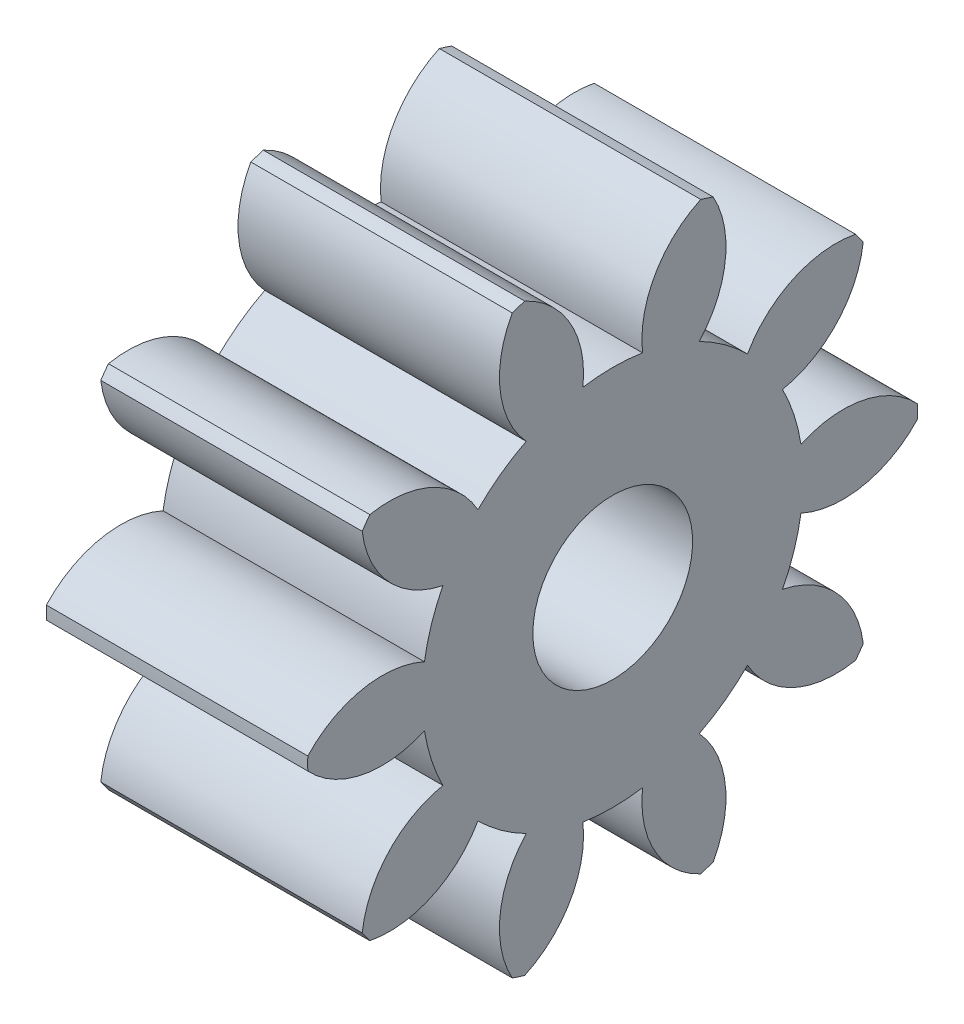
ISO-10303-21;
HEADER;
FILE_DESCRIPTION(('STEP AP214'),'2;1');
FILE_NAME('part.step','',(''),(''),'','','');
FILE_SCHEMA(('AUTOMOTIVE_DESIGN { 1 0 10303 214 1 1 1 1 }'));
ENDSEC;
DATA;
#1=APPLICATION_CONTEXT('core data for automotive mechanical design processes');
#2=APPLICATION_PROTOCOL_DEFINITION('international standard','automotive_design',2000,#1);
#3=PRODUCT_CONTEXT('',#1,'mechanical');
#4=PRODUCT('Part','Part','',(#3));
#5=PRODUCT_RELATED_PRODUCT_CATEGORY('part','',(#4));
#6=PRODUCT_DEFINITION_FORMATION('','',#4);
#7=PRODUCT_DEFINITION_CONTEXT('part definition',#1,'design');
#8=PRODUCT_DEFINITION('design','',#6,#7);
#9=PRODUCT_DEFINITION_SHAPE('','',#8);
#10=(LENGTH_UNIT() NAMED_UNIT(*) SI_UNIT(.MILLI.,.METRE.));
#11=(NAMED_UNIT(*) PLANE_ANGLE_UNIT() SI_UNIT($,.RADIAN.));
#12=(NAMED_UNIT(*) SI_UNIT($,.STERADIAN.) SOLID_ANGLE_UNIT());
#13=UNCERTAINTY_MEASURE_WITH_UNIT(LENGTH_MEASURE(1.E-05),#10,'distance_accuracy_value','');
#14=(GEOMETRIC_REPRESENTATION_CONTEXT(3) GLOBAL_UNCERTAINTY_ASSIGNED_CONTEXT((#13)) GLOBAL_UNIT_ASSIGNED_CONTEXT((#10,
#11,#12)) REPRESENTATION_CONTEXT('',''));
#15=CARTESIAN_POINT('',(0.,0.,0.));
#16=DIRECTION('',(0.,0.,1.));
#17=DIRECTION('',(1.,0.,0.));
#18=AXIS2_PLACEMENT_3D('',#15,#16,#17);
#19=CARTESIAN_POINT('',(18.,0.,0.));
#20=DIRECTION('',(-1.,0.,0.));
#21=DIRECTION('',(0.,0.,1.));
#22=AXIS2_PLACEMENT_3D('',#19,#20,#21);
#23=PLANE('',#22);
#24=CARTESIAN_POINT('',(18.,0.,0.));
#25=DIRECTION('',(-1.,0.,0.));
#26=DIRECTION('',(0.,0.,1.));
#27=AXIS2_PLACEMENT_3D('',#24,#25,#26);
#28=CIRCLE('',#27,5.5);
#29=CARTESIAN_POINT('',(18.,0.,5.5));
#30=VERTEX_POINT('',#29);
#31=EDGE_CURVE('E358',#30,#30,#28,.F.);
#32=ORIENTED_EDGE('',*,*,#31,.F.);
#33=EDGE_LOOP('',(#32));
#34=FACE_BOUND('',#33,.T.);
#35=CARTESIAN_POINT('',(18.,-4.31583887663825,-15.8681785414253));
#36=DIRECTION('',(-1.,0.,0.));
#37=DIRECTION('',(0.,-0.95105651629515,-0.309016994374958));
#38=AXIS2_PLACEMENT_3D('',#35,#36,#37);
#39=CIRCLE('',#38,7.000000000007);
#40=CARTESIAN_POINT('',(18.,2.05259812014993,-12.9624926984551));
#41=VERTEX_POINT('',#40);
#42=CARTESIAN_POINT('',(18.,0.450070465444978,-20.9951765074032));
#43=VERTEX_POINT('',#42);
#44=EDGE_CURVE('E364',#41,#43,#39,.T.);
#45=ORIENTED_EDGE('',*,*,#44,.F.);
#46=CARTESIAN_POINT('',(18.,0.,0.));
#47=DIRECTION('',(-1.,0.,0.));
#48=DIRECTION('',(0.,-0.95105651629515,-0.309016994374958));
#49=AXIS2_PLACEMENT_3D('',#46,#47,#48);
#50=CIRCLE('',#49,13.1240000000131);
#51=CARTESIAN_POINT('',(18.,5.95857527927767,-11.6933637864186));
#52=VERTEX_POINT('',#51);
#53=EDGE_CURVE('E369',#52,#41,#50,.T.);
#54=ORIENTED_EDGE('',*,*,#53,.F.);
#55=CARTESIAN_POINT('',(18.,12.8186683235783,-10.3008396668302));
#56=DIRECTION('',(-1.,0.,0.));
#57=DIRECTION('',(0.,-0.95105651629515,-0.309016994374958));
#58=AXIS2_PLACEMENT_3D('',#55,#56,#57);
#59=CIRCLE('',#58,7.000000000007);
#60=CARTESIAN_POINT('',(18.,11.9765404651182,-17.2499993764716));
#61=VERTEX_POINT('',#60);
#62=EDGE_CURVE('E366',#61,#52,#59,.T.);
#63=ORIENTED_EDGE('',*,*,#62,.F.);
#64=CARTESIAN_POINT('',(18.,0.,0.));
#65=DIRECTION('',(-1.,0.,0.));
#66=DIRECTION('',(0.,0.,1.));
#67=AXIS2_PLACEMENT_3D('',#64,#65,#66);
#68=CIRCLE('',#67,21.000000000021);
#69=CARTESIAN_POINT('',(18.,12.7047697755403,-16.7209098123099));
#70=VERTEX_POINT('',#69);
#71=EDGE_CURVE('E530',#70,#61,#68,.T.);
#72=ORIENTED_EDGE('',*,*,#71,.F.);
#73=CARTESIAN_POINT('',(18.,5.83549433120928,-15.3744125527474));
#74=DIRECTION('',(-1.,0.,0.));
#75=DIRECTION('',(0.,-0.587785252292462,-0.809016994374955));
#76=AXIS2_PLACEMENT_3D('',#73,#74,#75);
#77=CIRCLE('',#76,7.000000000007);
#78=CARTESIAN_POINT('',(18.,9.27974880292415,-9.28038997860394));
#79=VERTEX_POINT('',#78);
#80=EDGE_CURVE('E349',#79,#70,#77,.T.);
#81=ORIENTED_EDGE('',*,*,#80,.F.);
#82=CARTESIAN_POINT('',(18.,0.,0.));
#83=DIRECTION('',(-1.,0.,0.));
#84=DIRECTION('',(0.,-0.587785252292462,-0.809016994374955));
#85=AXIS2_PLACEMENT_3D('',#82,#83,#84);
#86=CIRCLE('',#85,13.1240000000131);
#87=CARTESIAN_POINT('',(18.,11.6937754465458,-5.95776735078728));
#88=VERTEX_POINT('',#87);
#89=EDGE_CURVE('E354',#88,#79,#86,.T.);
#90=ORIENTED_EDGE('',*,*,#89,.F.);
#91=CARTESIAN_POINT('',(18.,16.4252021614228,-0.798930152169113));
#92=DIRECTION('',(-1.,0.,0.));
#93=DIRECTION('',(0.,-0.587785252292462,-0.809016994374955));
#94=AXIS2_PLACEMENT_3D('',#91,#92,#93);
#95=CIRCLE('',#94,7.000000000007);
#96=CARTESIAN_POINT('',(18.,19.8285200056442,-6.91590878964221));
#97=VERTEX_POINT('',#96);
#98=EDGE_CURVE('E351',#97,#88,#95,.T.);
#99=ORIENTED_EDGE('',*,*,#98,.F.);
#100=CARTESIAN_POINT('',(18.,20.1066788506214,-6.05982389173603));
#101=VERTEX_POINT('',#100);
#102=EDGE_CURVE('E526',#101,#97,#68,.T.);
#103=ORIENTED_EDGE('',*,*,#102,.F.);
#104=CARTESIAN_POINT('',(18.,13.7578670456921,-9.00814352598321));
#105=DIRECTION('',(-1.,0.,0.));
#106=DIRECTION('',(0.,0.,-1.));
#107=AXIS2_PLACEMENT_3D('',#104,#105,#106);
#108=CIRCLE('',#107,7.000000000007);
#109=CARTESIAN_POINT('',(18.,12.9623508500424,-2.05349371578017));
#110=VERTEX_POINT('',#109);
#111=EDGE_CURVE('E498',#110,#101,#108,.T.);
#112=ORIENTED_EDGE('',*,*,#111,.F.);
#113=CARTESIAN_POINT('',(18.,0.,0.));
#114=DIRECTION('',(-1.,0.,0.));
#115=DIRECTION('',(0.,0.,-1.));
#116=AXIS2_PLACEMENT_3D('',#113,#114,#115);
#117=CIRCLE('',#116,13.1240000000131);
#118=CARTESIAN_POINT('',(18.,12.9623508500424,2.05349371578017));
#119=VERTEX_POINT('',#118);
#120=EDGE_CURVE('E503',#119,#110,#117,.T.);
#121=ORIENTED_EDGE('',*,*,#120,.F.);
#122=CARTESIAN_POINT('',(18.,13.7578670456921,9.00814352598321));
#123=DIRECTION('',(-1.,0.,0.));
#124=DIRECTION('',(0.,0.,-1.));
#125=AXIS2_PLACEMENT_3D('',#122,#123,#124);
#126=CIRCLE('',#125,7.000000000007);
#127=CARTESIAN_POINT('',(18.,20.1066788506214,6.05982389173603));
#128=VERTEX_POINT('',#127);
#129=EDGE_CURVE('E500',#128,#119,#126,.T.);
#130=ORIENTED_EDGE('',*,*,#129,.F.);
#131=CARTESIAN_POINT('',(18.,19.8285200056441,6.9159087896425));
#132=VERTEX_POINT('',#131);
#133=EDGE_CURVE('E523',#132,#128,#68,.T.);
#134=ORIENTED_EDGE('',*,*,#133,.F.);
#135=CARTESIAN_POINT('',(18.,16.4252021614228,0.798930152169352));
#136=DIRECTION('',(-1.,0.,0.));
#137=DIRECTION('',(0.,0.587785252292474,-0.809016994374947));
#138=AXIS2_PLACEMENT_3D('',#135,#136,#137);
#139=CIRCLE('',#138,7.000000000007);
#140=CARTESIAN_POINT('',(18.,11.6937754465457,5.95776735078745));
#141=VERTEX_POINT('',#140);
#142=EDGE_CURVE('E476',#141,#132,#139,.T.);
#143=ORIENTED_EDGE('',*,*,#142,.F.);
#144=CARTESIAN_POINT('',(18.,0.,0.));
#145=DIRECTION('',(-1.,0.,0.));
#146=DIRECTION('',(0.,0.587785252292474,-0.809016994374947));
#147=AXIS2_PLACEMENT_3D('',#144,#145,#146);
#148=CIRCLE('',#147,13.1240000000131);
#149=CARTESIAN_POINT('',(18.,9.27974880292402,9.28038997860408));
#150=VERTEX_POINT('',#149);
#151=EDGE_CURVE('E481',#150,#141,#148,.T.);
#152=ORIENTED_EDGE('',*,*,#151,.F.);
#153=CARTESIAN_POINT('',(18.,5.83549433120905,15.3744125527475));
#154=DIRECTION('',(-1.,0.,0.));
#155=DIRECTION('',(0.,0.587785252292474,-0.809016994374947));
#156=AXIS2_PLACEMENT_3D('',#153,#154,#155);
#157=CIRCLE('',#156,7.000000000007);
#158=CARTESIAN_POINT('',(18.,12.70476977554,16.72090981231));
#159=VERTEX_POINT('',#158);
#160=EDGE_CURVE('E478',#159,#150,#157,.T.);
#161=ORIENTED_EDGE('',*,*,#160,.F.);
#162=CARTESIAN_POINT('',(18.,11.9765404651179,17.2499993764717));
#163=VERTEX_POINT('',#162);
#164=EDGE_CURVE('E531',#163,#159,#68,.T.);
#165=ORIENTED_EDGE('',*,*,#164,.F.);
#166=CARTESIAN_POINT('',(18.,12.8186683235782,10.3008396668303));
#167=DIRECTION('',(-1.,0.,0.));
#168=DIRECTION('',(0.,0.951056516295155,-0.309016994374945));
#169=AXIS2_PLACEMENT_3D('',#166,#167,#168);
#170=CIRCLE('',#169,7.000000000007);
#171=CARTESIAN_POINT('',(18.,5.95857527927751,11.6933637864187));
#172=VERTEX_POINT('',#171);
#173=EDGE_CURVE('E411',#172,#163,#170,.T.);
#174=ORIENTED_EDGE('',*,*,#173,.F.);
#175=CARTESIAN_POINT('',(18.,0.,0.));
#176=DIRECTION('',(-1.,0.,0.));
#177=DIRECTION('',(0.,0.951056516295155,-0.309016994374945));
#178=AXIS2_PLACEMENT_3D('',#175,#176,#177);
#179=CIRCLE('',#178,13.1240000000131);
#180=CARTESIAN_POINT('',(18.,2.05259812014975,12.9624926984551));
#181=VERTEX_POINT('',#180);
#182=EDGE_CURVE('E416',#181,#172,#179,.T.);
#183=ORIENTED_EDGE('',*,*,#182,.F.);
#184=CARTESIAN_POINT('',(18.,-4.31583887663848,15.8681785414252));
#185=DIRECTION('',(-1.,0.,0.));
#186=DIRECTION('',(0.,0.951056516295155,-0.309016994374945));
#187=AXIS2_PLACEMENT_3D('',#184,#185,#186);
#188=CIRCLE('',#187,7.000000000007);
#189=CARTESIAN_POINT('',(18.,0.45007046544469,20.9951765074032));
#190=VERTEX_POINT('',#189);
#191=EDGE_CURVE('E413',#190,#181,#188,.T.);
#192=ORIENTED_EDGE('',*,*,#191,.F.);
#193=CARTESIAN_POINT('',(18.,-0.450070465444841,20.9951765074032));
#194=VERTEX_POINT('',#193);
#195=EDGE_CURVE('E694',#194,#190,#68,.T.);
#196=ORIENTED_EDGE('',*,*,#195,.F.);
#197=CARTESIAN_POINT('',(18.,4.31583887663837,15.8681785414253));
#198=DIRECTION('',(-1.,0.,0.));
#199=DIRECTION('',(0.,0.951056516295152,0.309016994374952));
#200=AXIS2_PLACEMENT_3D('',#197,#198,#199);
#201=CIRCLE('',#200,7.000000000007);
#202=CARTESIAN_POINT('',(18.,-2.05259812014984,12.9624926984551));
#203=VERTEX_POINT('',#202);
#204=EDGE_CURVE('E430',#203,#194,#201,.T.);
#205=ORIENTED_EDGE('',*,*,#204,.F.);
#206=CARTESIAN_POINT('',(18.,0.,0.));
#207=DIRECTION('',(-1.,0.,0.));
#208=DIRECTION('',(0.,0.951056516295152,0.309016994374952));
#209=AXIS2_PLACEMENT_3D('',#206,#207,#208);
#210=CIRCLE('',#209,13.1240000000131);
#211=CARTESIAN_POINT('',(18.,-5.95857527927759,11.6933637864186));
#212=VERTEX_POINT('',#211);
#213=EDGE_CURVE('E435',#212,#203,#210,.T.);
#214=ORIENTED_EDGE('',*,*,#213,.F.);
#215=CARTESIAN_POINT('',(18.,-12.8186683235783,10.3008396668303));
#216=DIRECTION('',(-1.,0.,0.));
#217=DIRECTION('',(0.,0.951056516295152,0.309016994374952));
#218=AXIS2_PLACEMENT_3D('',#215,#216,#217);
#219=CIRCLE('',#218,7.000000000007);
#220=CARTESIAN_POINT('',(18.,-11.976540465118,17.2499993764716));
#221=VERTEX_POINT('',#220);
#222=EDGE_CURVE('E432',#221,#212,#219,.T.);
#223=ORIENTED_EDGE('',*,*,#222,.F.);
#224=CARTESIAN_POINT('',(18.,-12.7047697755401,16.72090981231));
#225=VERTEX_POINT('',#224);
#226=EDGE_CURVE('E675',#225,#221,#68,.T.);
#227=ORIENTED_EDGE('',*,*,#226,.F.);
#228=CARTESIAN_POINT('',(18.,-5.83549433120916,15.3744125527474));
#229=DIRECTION('',(-1.,0.,0.));
#230=DIRECTION('',(0.,0.587785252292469,0.809016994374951));
#231=AXIS2_PLACEMENT_3D('',#228,#229,#230);
#232=CIRCLE('',#231,7.000000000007);
#233=CARTESIAN_POINT('',(18.,-9.27974880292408,9.28038997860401));
#234=VERTEX_POINT('',#233);
#235=EDGE_CURVE('E394',#234,#225,#232,.T.);
#236=ORIENTED_EDGE('',*,*,#235,.F.);
#237=CARTESIAN_POINT('',(18.,0.,0.));
#238=DIRECTION('',(-1.,0.,0.));
#239=DIRECTION('',(0.,0.587785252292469,0.809016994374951));
#240=AXIS2_PLACEMENT_3D('',#237,#238,#239);
#241=CIRCLE('',#240,13.1240000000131);
#242=CARTESIAN_POINT('',(18.,-11.6937754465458,5.95776735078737));
#243=VERTEX_POINT('',#242);
#244=EDGE_CURVE('E399',#243,#234,#241,.T.);
#245=ORIENTED_EDGE('',*,*,#244,.F.);
#246=CARTESIAN_POINT('',(18.,-16.4252021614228,0.798930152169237));
#247=DIRECTION('',(-1.,0.,0.));
#248=DIRECTION('',(0.,0.587785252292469,0.809016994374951));
#249=AXIS2_PLACEMENT_3D('',#246,#247,#248);
#250=CIRCLE('',#249,7.000000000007);
#251=CARTESIAN_POINT('',(18.,-19.8285200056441,6.91590878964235));
#252=VERTEX_POINT('',#251);
#253=EDGE_CURVE('E396',#252,#243,#250,.T.);
#254=ORIENTED_EDGE('',*,*,#253,.F.);
#255=CARTESIAN_POINT('',(18.,-20.1066788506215,6.05982389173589));
#256=VERTEX_POINT('',#255);
#257=EDGE_CURVE('E656',#256,#252,#68,.T.);
#258=ORIENTED_EDGE('',*,*,#257,.F.);
#259=CARTESIAN_POINT('',(18.,-13.7578670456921,9.00814352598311));
#260=DIRECTION('',(-1.,0.,0.));
#261=DIRECTION('',(0.,0.,1.));
#262=AXIS2_PLACEMENT_3D('',#259,#260,#261);
#263=CIRCLE('',#262,7.000000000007);
#264=CARTESIAN_POINT('',(18.,-12.9623508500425,2.05349371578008));
#265=VERTEX_POINT('',#264);
#266=EDGE_CURVE('E377',#265,#256,#263,.T.);
#267=ORIENTED_EDGE('',*,*,#266,.F.);
#268=CARTESIAN_POINT('',(18.,0.,0.));
#269=DIRECTION('',(-1.,0.,0.));
#270=DIRECTION('',(0.,0.,1.));
#271=AXIS2_PLACEMENT_3D('',#268,#269,#270);
#272=CIRCLE('',#271,13.1240000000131);
#273=CARTESIAN_POINT('',(18.,-12.9623508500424,-2.05349371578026));
#274=VERTEX_POINT('',#273);
#275=EDGE_CURVE('E382',#274,#265,#272,.T.);
#276=ORIENTED_EDGE('',*,*,#275,.F.);
#277=CARTESIAN_POINT('',(18.,-13.757867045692,-9.0081435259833));
#278=DIRECTION('',(-1.,0.,0.));
#279=DIRECTION('',(0.,0.,1.));
#280=AXIS2_PLACEMENT_3D('',#277,#278,#279);
#281=CIRCLE('',#280,7.000000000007);
#282=CARTESIAN_POINT('',(18.,-20.1066788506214,-6.05982389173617));
#283=VERTEX_POINT('',#282);
#284=EDGE_CURVE('E379',#283,#274,#281,.T.);
#285=ORIENTED_EDGE('',*,*,#284,.F.);
#286=CARTESIAN_POINT('',(18.,-19.828520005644,-6.91590878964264));
#287=VERTEX_POINT('',#286);
#288=EDGE_CURVE('E637',#287,#283,#68,.T.);
#289=ORIENTED_EDGE('',*,*,#288,.F.);
#290=CARTESIAN_POINT('',(18.,-16.4252021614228,-0.798930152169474));
#291=DIRECTION('',(-1.,0.,0.));
#292=DIRECTION('',(0.,-0.58778525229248,0.809016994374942));
#293=AXIS2_PLACEMENT_3D('',#290,#291,#292);
#294=CIRCLE('',#293,7.000000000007);
#295=CARTESIAN_POINT('',(18.,-11.6937754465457,-5.95776735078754));
#296=VERTEX_POINT('',#295);
#297=EDGE_CURVE('E332',#296,#287,#294,.T.);
#298=ORIENTED_EDGE('',*,*,#297,.F.);
#299=CARTESIAN_POINT('',(18.,0.,0.));
#300=DIRECTION('',(-1.,0.,0.));
#301=DIRECTION('',(0.,-0.58778525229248,0.809016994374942));
#302=AXIS2_PLACEMENT_3D('',#299,#300,#301);
#303=CIRCLE('',#302,13.1240000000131);
#304=CARTESIAN_POINT('',(18.,-9.27974880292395,-9.28038997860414));
#305=VERTEX_POINT('',#304);
#306=EDGE_CURVE('E337',#305,#296,#303,.T.);
#307=ORIENTED_EDGE('',*,*,#306,.F.);
#308=CARTESIAN_POINT('',(18.,-5.83549433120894,-15.3744125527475));
#309=DIRECTION('',(-1.,0.,0.));
#310=DIRECTION('',(0.,-0.58778525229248,0.809016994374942));
#311=AXIS2_PLACEMENT_3D('',#308,#309,#310);
#312=CIRCLE('',#311,7.000000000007);
#313=CARTESIAN_POINT('',(18.,-12.7047697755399,-16.7209098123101));
#314=VERTEX_POINT('',#313);
#315=EDGE_CURVE('E334',#314,#305,#312,.T.);
#316=ORIENTED_EDGE('',*,*,#315,.F.);
#317=CARTESIAN_POINT('',(18.,-11.9765404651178,-17.2499993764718));
#318=VERTEX_POINT('',#317);
#319=EDGE_CURVE('E618',#318,#314,#68,.T.);
#320=ORIENTED_EDGE('',*,*,#319,.F.);
#321=CARTESIAN_POINT('',(18.,-12.8186683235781,-10.3008396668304));
#322=DIRECTION('',(-1.,0.,0.));
#323=DIRECTION('',(0.,-0.951056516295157,0.309016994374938));
#324=AXIS2_PLACEMENT_3D('',#321,#322,#323);
#325=CIRCLE('',#324,7.000000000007);
#326=CARTESIAN_POINT('',(18.,-5.95857527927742,-11.6933637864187));
#327=VERTEX_POINT('',#326);
#328=EDGE_CURVE('E308',#327,#318,#325,.T.);
#329=ORIENTED_EDGE('',*,*,#328,.F.);
#330=CARTESIAN_POINT('',(18.,0.,0.));
#331=DIRECTION('',(-1.,0.,0.));
#332=DIRECTION('',(0.,-0.951056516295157,0.309016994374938));
#333=AXIS2_PLACEMENT_3D('',#330,#331,#332);
#334=CIRCLE('',#333,13.1240000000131);
#335=CARTESIAN_POINT('',(18.,-2.05259812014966,-12.9624926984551));
#336=VERTEX_POINT('',#335);
#337=EDGE_CURVE('E307',#336,#327,#334,.T.);
#338=ORIENTED_EDGE('',*,*,#337,.F.);
#339=CARTESIAN_POINT('',(18.,4.31583887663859,-15.8681785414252));
#340=DIRECTION('',(-1.,0.,0.));
#341=DIRECTION('',(0.,-0.951056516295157,0.309016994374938));
#342=AXIS2_PLACEMENT_3D('',#339,#340,#341);
#343=CIRCLE('',#342,7.000000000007);
#344=CARTESIAN_POINT('',(18.,-0.450070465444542,-20.9951765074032));
#345=VERTEX_POINT('',#344);
#346=EDGE_CURVE('E296',#345,#336,#343,.T.);
#347=ORIENTED_EDGE('',*,*,#346,.F.);
#348=EDGE_CURVE('E756',#43,#345,#68,.T.);
#349=ORIENTED_EDGE('',*,*,#348,.F.);
#350=EDGE_LOOP('',(#45,#54,#63,#72,#81,#90,#99,#103,#112,#121,#130,#134,#143,#152,#161,#165,
#174,#183,#192,#196,#205,#214,#223,#227,#236,#245,#254,#258,#267,#276,#285,#289,#298,#307,#316,
#320,#329,#338,#347,#349));
#351=FACE_BOUND('',#350,.T.);
#352=ADVANCED_FACE('F39',(#34,#351),#23,.F.);
#353=CARTESIAN_POINT('',(-10.,0.,0.));
#354=DIRECTION('',(-1.,0.,0.));
#355=DIRECTION('',(0.,0.,1.));
#356=AXIS2_PLACEMENT_3D('',#353,#354,#355);
#357=CYLINDRICAL_SURFACE('',#356,21.000000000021);
#358=DIRECTION('',(-1.,0.,0.));
#359=VECTOR('',#358,1.);
#360=CARTESIAN_POINT('',(9.,0.450070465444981,-20.9951765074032));
#361=LINE('',#360,#359);
#362=CARTESIAN_POINT('',(0.,0.450070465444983,-20.9951765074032));
#363=VERTEX_POINT('',#362);
#364=EDGE_CURVE('E473',#43,#363,#361,.T.);
#365=ORIENTED_EDGE('',*,*,#364,.F.);
#366=ORIENTED_EDGE('',*,*,#348,.T.);
#367=DIRECTION('',(-1.,0.,0.));
#368=VECTOR('',#367,1.);
#369=CARTESIAN_POINT('',(9.,-0.450070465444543,-20.9951765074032));
#370=LINE('',#369,#368);
#371=CARTESIAN_POINT('',(0.,-0.450070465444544,-20.9951765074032));
#372=VERTEX_POINT('',#371);
#373=EDGE_CURVE('E302',#372,#345,#370,.F.);
#374=ORIENTED_EDGE('',*,*,#373,.F.);
#375=CARTESIAN_POINT('',(0.,0.,0.));
#376=DIRECTION('',(-1.,0.,0.));
#377=DIRECTION('',(0.,0.,1.));
#378=AXIS2_PLACEMENT_3D('',#375,#376,#377);
#379=CIRCLE('',#378,21.000000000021);
#380=EDGE_CURVE('E588',#363,#372,#379,.T.);
#381=ORIENTED_EDGE('',*,*,#380,.F.);
#382=EDGE_LOOP('',(#365,#366,#374,#381));
#383=FACE_BOUND('',#382,.T.);
#384=ADVANCED_FACE('F739',(#383),#357,.T.);
#385=DIRECTION('',(-1.,0.,0.));
#386=VECTOR('',#385,1.);
#387=CARTESIAN_POINT('',(9.,11.9765404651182,-17.2499993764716));
#388=LINE('',#387,#386);
#389=CARTESIAN_POINT('',(0.,11.9765404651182,-17.2499993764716));
#390=VERTEX_POINT('',#389);
#391=EDGE_CURVE('E471',#390,#61,#388,.F.);
#392=ORIENTED_EDGE('',*,*,#391,.F.);
#393=CARTESIAN_POINT('',(0.,12.7047697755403,-16.7209098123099));
#394=VERTEX_POINT('',#393);
#395=EDGE_CURVE('E524',#394,#390,#379,.T.);
#396=ORIENTED_EDGE('',*,*,#395,.F.);
#397=DIRECTION('',(-1.,0.,0.));
#398=VECTOR('',#397,1.);
#399=CARTESIAN_POINT('',(9.,12.7047697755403,-16.7209098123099));
#400=LINE('',#399,#398);
#401=EDGE_CURVE('E469',#70,#394,#400,.T.);
#402=ORIENTED_EDGE('',*,*,#401,.F.);
#403=ORIENTED_EDGE('',*,*,#71,.T.);
#404=EDGE_LOOP('',(#392,#396,#402,#403));
#405=FACE_BOUND('',#404,.T.);
#406=ADVANCED_FACE('F585',(#405),#357,.T.);
#407=DIRECTION('',(-1.,0.,0.));
#408=VECTOR('',#407,1.);
#409=CARTESIAN_POINT('',(9.,19.8285200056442,-6.9159087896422));
#410=LINE('',#409,#408);
#411=CARTESIAN_POINT('',(0.,19.8285200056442,-6.91590878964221));
#412=VERTEX_POINT('',#411);
#413=EDGE_CURVE('E467',#412,#97,#410,.F.);
#414=ORIENTED_EDGE('',*,*,#413,.F.);
#415=CARTESIAN_POINT('',(0.,20.1066788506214,-6.05982389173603));
#416=VERTEX_POINT('',#415);
#417=EDGE_CURVE('E520',#416,#412,#379,.T.);
#418=ORIENTED_EDGE('',*,*,#417,.F.);
#419=DIRECTION('',(-1.,0.,0.));
#420=VECTOR('',#419,1.);
#421=CARTESIAN_POINT('',(9.,20.1066788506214,-6.05982389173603));
#422=LINE('',#421,#420);
#423=EDGE_CURVE('E517',#101,#416,#422,.T.);
#424=ORIENTED_EDGE('',*,*,#423,.F.);
#425=ORIENTED_EDGE('',*,*,#102,.T.);
#426=EDGE_LOOP('',(#414,#418,#424,#425));
#427=FACE_BOUND('',#426,.T.);
#428=ADVANCED_FACE('F559',(#427),#357,.T.);
#429=DIRECTION('',(-1.,0.,0.));
#430=VECTOR('',#429,1.);
#431=CARTESIAN_POINT('',(9.,-19.828520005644,-6.91590878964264));
#432=LINE('',#431,#430);
#433=CARTESIAN_POINT('',(0.,-19.828520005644,-6.91590878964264));
#434=VERTEX_POINT('',#433);
#435=EDGE_CURVE('E465',#287,#434,#432,.T.);
#436=ORIENTED_EDGE('',*,*,#435,.F.);
#437=ORIENTED_EDGE('',*,*,#288,.T.);
#438=DIRECTION('',(-1.,0.,0.));
#439=VECTOR('',#438,1.);
#440=CARTESIAN_POINT('',(9.,-20.1066788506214,-6.05982389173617));
#441=LINE('',#440,#439);
#442=CARTESIAN_POINT('',(0.,-20.1066788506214,-6.05982389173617));
#443=VERTEX_POINT('',#442);
#444=EDGE_CURVE('E448',#443,#283,#441,.F.);
#445=ORIENTED_EDGE('',*,*,#444,.F.);
#446=EDGE_CURVE('E604',#434,#443,#379,.T.);
#447=ORIENTED_EDGE('',*,*,#446,.F.);
#448=EDGE_LOOP('',(#436,#437,#445,#447));
#449=FACE_BOUND('',#448,.T.);
#450=ADVANCED_FACE('F635',(#449),#357,.T.);
#451=DIRECTION('',(-1.,0.,0.));
#452=VECTOR('',#451,1.);
#453=CARTESIAN_POINT('',(9.,-12.7047697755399,-16.7209098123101));
#454=LINE('',#453,#452);
#455=CARTESIAN_POINT('',(0.,-12.7047697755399,-16.7209098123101));
#456=VERTEX_POINT('',#455);
#457=EDGE_CURVE('E463',#456,#314,#454,.F.);
#458=ORIENTED_EDGE('',*,*,#457,.F.);
#459=CARTESIAN_POINT('',(0.,-11.9765404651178,-17.2499993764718));
#460=VERTEX_POINT('',#459);
#461=EDGE_CURVE('E590',#460,#456,#379,.T.);
#462=ORIENTED_EDGE('',*,*,#461,.F.);
#463=DIRECTION('',(-1.,0.,0.));
#464=VECTOR('',#463,1.);
#465=CARTESIAN_POINT('',(9.,-11.9765404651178,-17.2499993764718));
#466=LINE('',#465,#464);
#467=EDGE_CURVE('E461',#318,#460,#466,.T.);
#468=ORIENTED_EDGE('',*,*,#467,.F.);
#469=ORIENTED_EDGE('',*,*,#319,.T.);
#470=EDGE_LOOP('',(#458,#462,#468,#469));
#471=FACE_BOUND('',#470,.T.);
#472=ADVANCED_FACE('F616',(#471),#357,.T.);
#473=DIRECTION('',(-1.,0.,0.));
#474=VECTOR('',#473,1.);
#475=CARTESIAN_POINT('',(9.,11.9765404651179,17.2499993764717));
#476=LINE('',#475,#474);
#477=CARTESIAN_POINT('',(0.,11.9765404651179,17.2499993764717));
#478=VERTEX_POINT('',#477);
#479=EDGE_CURVE('E458',#163,#478,#476,.T.);
#480=ORIENTED_EDGE('',*,*,#479,.F.);
#481=ORIENTED_EDGE('',*,*,#164,.T.);
#482=DIRECTION('',(-1.,0.,0.));
#483=VECTOR('',#482,1.);
#484=CARTESIAN_POINT('',(9.,12.70476977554,16.72090981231));
#485=LINE('',#484,#483);
#486=CARTESIAN_POINT('',(0.,12.70476977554,16.72090981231));
#487=VERTEX_POINT('',#486);
#488=EDGE_CURVE('E492',#487,#159,#485,.F.);
#489=ORIENTED_EDGE('',*,*,#488,.F.);
#490=EDGE_CURVE('E525',#478,#487,#379,.T.);
#491=ORIENTED_EDGE('',*,*,#490,.F.);
#492=EDGE_LOOP('',(#480,#481,#489,#491));
#493=FACE_BOUND('',#492,.T.);
#494=ADVANCED_FACE('F711',(#493),#357,.T.);
#495=DIRECTION('',(-1.,0.,0.));
#496=VECTOR('',#495,1.);
#497=CARTESIAN_POINT('',(9.,0.450070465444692,20.9951765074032));
#498=LINE('',#497,#496);
#499=CARTESIAN_POINT('',(0.,0.450070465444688,20.9951765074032));
#500=VERTEX_POINT('',#499);
#501=EDGE_CURVE('E456',#500,#190,#498,.F.);
#502=ORIENTED_EDGE('',*,*,#501,.F.);
#503=CARTESIAN_POINT('',(0.,-0.450070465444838,20.9951765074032));
#504=VERTEX_POINT('',#503);
#505=EDGE_CURVE('E592',#504,#500,#379,.T.);
#506=ORIENTED_EDGE('',*,*,#505,.F.);
#507=DIRECTION('',(-1.,0.,0.));
#508=VECTOR('',#507,1.);
#509=CARTESIAN_POINT('',(9.,-0.450070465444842,20.9951765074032));
#510=LINE('',#509,#508);
#511=EDGE_CURVE('E454',#194,#504,#510,.T.);
#512=ORIENTED_EDGE('',*,*,#511,.F.);
#513=ORIENTED_EDGE('',*,*,#195,.T.);
#514=EDGE_LOOP('',(#502,#506,#512,#513));
#515=FACE_BOUND('',#514,.T.);
#516=ADVANCED_FACE('F692',(#515),#357,.T.);
#517=DIRECTION('',(-1.,0.,0.));
#518=VECTOR('',#517,1.);
#519=CARTESIAN_POINT('',(9.,-11.976540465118,17.2499993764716));
#520=LINE('',#519,#518);
#521=CARTESIAN_POINT('',(0.,-11.976540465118,17.2499993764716));
#522=VERTEX_POINT('',#521);
#523=EDGE_CURVE('E452',#522,#221,#520,.F.);
#524=ORIENTED_EDGE('',*,*,#523,.F.);
#525=CARTESIAN_POINT('',(0.,-12.7047697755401,16.72090981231));
#526=VERTEX_POINT('',#525);
#527=EDGE_CURVE('E596',#526,#522,#379,.T.);
#528=ORIENTED_EDGE('',*,*,#527,.F.);
#529=DIRECTION('',(-1.,0.,0.));
#530=VECTOR('',#529,1.);
#531=CARTESIAN_POINT('',(9.,-12.7047697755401,16.72090981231));
#532=LINE('',#531,#530);
#533=EDGE_CURVE('E446',#225,#526,#532,.T.);
#534=ORIENTED_EDGE('',*,*,#533,.F.);
#535=ORIENTED_EDGE('',*,*,#226,.T.);
#536=EDGE_LOOP('',(#524,#528,#534,#535));
#537=FACE_BOUND('',#536,.T.);
#538=ADVANCED_FACE('F673',(#537),#357,.T.);
#539=DIRECTION('',(-1.,0.,0.));
#540=VECTOR('',#539,1.);
#541=CARTESIAN_POINT('',(9.,-20.1066788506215,6.0598238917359));
#542=LINE('',#541,#540);
#543=CARTESIAN_POINT('',(0.,-20.1066788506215,6.05982389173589));
#544=VERTEX_POINT('',#543);
#545=EDGE_CURVE('E450',#256,#544,#542,.T.);
#546=ORIENTED_EDGE('',*,*,#545,.F.);
#547=ORIENTED_EDGE('',*,*,#257,.T.);
#548=DIRECTION('',(-1.,0.,0.));
#549=VECTOR('',#548,1.);
#550=CARTESIAN_POINT('',(9.,-19.8285200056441,6.91590878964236));
#551=LINE('',#550,#549);
#552=CARTESIAN_POINT('',(0.,-19.8285200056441,6.91590878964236));
#553=VERTEX_POINT('',#552);
#554=EDGE_CURVE('E429',#553,#252,#551,.F.);
#555=ORIENTED_EDGE('',*,*,#554,.F.);
#556=EDGE_CURVE('E600',#544,#553,#379,.T.);
#557=ORIENTED_EDGE('',*,*,#556,.F.);
#558=EDGE_LOOP('',(#546,#547,#555,#557));
#559=FACE_BOUND('',#558,.T.);
#560=ADVANCED_FACE('F654',(#559),#357,.T.);
#561=CARTESIAN_POINT('',(0.,0.,0.));
#562=DIRECTION('',(1.,0.,0.));
#563=DIRECTION('',(0.,0.,-1.));
#564=AXIS2_PLACEMENT_3D('',#561,#562,#563);
#565=PLANE('',#564);
#566=CARTESIAN_POINT('',(0.,0.,0.));
#567=DIRECTION('',(1.,0.,0.));
#568=DIRECTION('',(0.,0.,-1.));
#569=AXIS2_PLACEMENT_3D('',#566,#567,#568);
#570=CIRCLE('',#569,5.5);
#571=CARTESIAN_POINT('',(0.,0.,-5.5));
#572=VERTEX_POINT('',#571);
#573=EDGE_CURVE('E42',#572,#572,#570,.F.);
#574=ORIENTED_EDGE('',*,*,#573,.F.);
#575=EDGE_LOOP('',(#574));
#576=FACE_BOUND('',#575,.T.);
#577=CARTESIAN_POINT('',(0.,-4.31583887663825,-15.8681785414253));
#578=DIRECTION('',(-1.,0.,0.));
#579=DIRECTION('',(0.,-0.95105651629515,-0.309016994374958));
#580=AXIS2_PLACEMENT_3D('',#577,#578,#579);
#581=CIRCLE('',#580,7.000000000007);
#582=CARTESIAN_POINT('',(0.,2.05259812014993,-12.9624926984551));
#583=VERTEX_POINT('',#582);
#584=EDGE_CURVE('E54',#583,#363,#581,.T.);
#585=ORIENTED_EDGE('',*,*,#584,.T.);
#586=ORIENTED_EDGE('',*,*,#380,.T.);
#587=CARTESIAN_POINT('',(0.,4.31583887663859,-15.8681785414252));
#588=DIRECTION('',(1.,0.,0.));
#589=DIRECTION('',(0.,0.,-1.));
#590=AXIS2_PLACEMENT_3D('',#587,#588,#589);
#591=CIRCLE('',#590,7.000000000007);
#592=CARTESIAN_POINT('',(0.,-2.05259812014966,-12.9624926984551));
#593=VERTEX_POINT('',#592);
#594=EDGE_CURVE('E545',#593,#372,#591,.T.);
#595=ORIENTED_EDGE('',*,*,#594,.F.);
#596=CARTESIAN_POINT('',(0.,0.,0.));
#597=DIRECTION('',(-1.,0.,0.));
#598=DIRECTION('',(0.,-0.951056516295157,0.309016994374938));
#599=AXIS2_PLACEMENT_3D('',#596,#597,#598);
#600=CIRCLE('',#599,13.1240000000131);
#601=CARTESIAN_POINT('',(0.,-5.95857527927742,-11.6933637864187));
#602=VERTEX_POINT('',#601);
#603=EDGE_CURVE('E315',#593,#602,#600,.T.);
#604=ORIENTED_EDGE('',*,*,#603,.T.);
#605=CARTESIAN_POINT('',(0.,-12.8186683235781,-10.3008396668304));
#606=DIRECTION('',(-1.,0.,0.));
#607=DIRECTION('',(0.,-0.951056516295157,0.309016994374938));
#608=AXIS2_PLACEMENT_3D('',#605,#606,#607);
#609=CIRCLE('',#608,7.000000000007);
#610=EDGE_CURVE('E327',#602,#460,#609,.T.);
#611=ORIENTED_EDGE('',*,*,#610,.T.);
#612=ORIENTED_EDGE('',*,*,#461,.T.);
#613=CARTESIAN_POINT('',(0.,-5.83549433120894,-15.3744125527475));
#614=DIRECTION('',(1.,0.,0.));
#615=DIRECTION('',(0.,0.,-1.));
#616=AXIS2_PLACEMENT_3D('',#613,#614,#615);
#617=CIRCLE('',#616,7.000000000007);
#618=CARTESIAN_POINT('',(0.,-9.27974880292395,-9.28038997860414));
#619=VERTEX_POINT('',#618);
#620=EDGE_CURVE('E547',#619,#456,#617,.T.);
#621=ORIENTED_EDGE('',*,*,#620,.F.);
#622=CARTESIAN_POINT('',(0.,0.,0.));
#623=DIRECTION('',(-1.,0.,0.));
#624=DIRECTION('',(0.,-0.58778525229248,0.809016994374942));
#625=AXIS2_PLACEMENT_3D('',#622,#623,#624);
#626=CIRCLE('',#625,13.1240000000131);
#627=CARTESIAN_POINT('',(0.,-11.6937754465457,-5.95776735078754));
#628=VERTEX_POINT('',#627);
#629=EDGE_CURVE('E335',#619,#628,#626,.T.);
#630=ORIENTED_EDGE('',*,*,#629,.T.);
#631=CARTESIAN_POINT('',(0.,-16.4252021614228,-0.798930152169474));
#632=DIRECTION('',(-1.,0.,0.));
#633=DIRECTION('',(0.,-0.58778525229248,0.809016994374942));
#634=AXIS2_PLACEMENT_3D('',#631,#632,#633);
#635=CIRCLE('',#634,7.000000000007);
#636=EDGE_CURVE('E317',#628,#434,#635,.T.);
#637=ORIENTED_EDGE('',*,*,#636,.T.);
#638=ORIENTED_EDGE('',*,*,#446,.T.);
#639=CARTESIAN_POINT('',(0.,-13.757867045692,-9.0081435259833));
#640=DIRECTION('',(1.,0.,0.));
#641=DIRECTION('',(0.,0.,-1.));
#642=AXIS2_PLACEMENT_3D('',#639,#640,#641);
#643=CIRCLE('',#642,7.000000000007);
#644=CARTESIAN_POINT('',(0.,-12.9623508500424,-2.05349371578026));
#645=VERTEX_POINT('',#644);
#646=EDGE_CURVE('E539',#645,#443,#643,.T.);
#647=ORIENTED_EDGE('',*,*,#646,.F.);
#648=CARTESIAN_POINT('',(0.,0.,0.));
#649=DIRECTION('',(-1.,0.,0.));
#650=DIRECTION('',(0.,0.,1.));
#651=AXIS2_PLACEMENT_3D('',#648,#649,#650);
#652=CIRCLE('',#651,13.1240000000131);
#653=CARTESIAN_POINT('',(0.,-12.9623508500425,2.05349371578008));
#654=VERTEX_POINT('',#653);
#655=EDGE_CURVE('E380',#645,#654,#652,.T.);
#656=ORIENTED_EDGE('',*,*,#655,.T.);
#657=CARTESIAN_POINT('',(0.,-13.7578670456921,9.00814352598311));
#658=DIRECTION('',(-1.,0.,0.));
#659=DIRECTION('',(0.,0.,1.));
#660=AXIS2_PLACEMENT_3D('',#657,#658,#659);
#661=CIRCLE('',#660,7.000000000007);
#662=EDGE_CURVE('E348',#654,#544,#661,.T.);
#663=ORIENTED_EDGE('',*,*,#662,.T.);
#664=ORIENTED_EDGE('',*,*,#556,.T.);
#665=CARTESIAN_POINT('',(0.,-16.4252021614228,0.798930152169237));
#666=DIRECTION('',(1.,0.,0.));
#667=DIRECTION('',(0.,0.,-1.));
#668=AXIS2_PLACEMENT_3D('',#665,#666,#667);
#669=CIRCLE('',#668,7.000000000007);
#670=CARTESIAN_POINT('',(0.,-11.6937754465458,5.95776735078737));
#671=VERTEX_POINT('',#670);
#672=EDGE_CURVE('E537',#671,#553,#669,.T.);
#673=ORIENTED_EDGE('',*,*,#672,.F.);
#674=CARTESIAN_POINT('',(0.,0.,0.));
#675=DIRECTION('',(-1.,0.,0.));
#676=DIRECTION('',(0.,0.587785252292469,0.809016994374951));
#677=AXIS2_PLACEMENT_3D('',#674,#675,#676);
#678=CIRCLE('',#677,13.1240000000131);
#679=CARTESIAN_POINT('',(0.,-9.27974880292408,9.28038997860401));
#680=VERTEX_POINT('',#679);
#681=EDGE_CURVE('E397',#671,#680,#678,.T.);
#682=ORIENTED_EDGE('',*,*,#681,.T.);
#683=CARTESIAN_POINT('',(0.,-5.83549433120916,15.3744125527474));
#684=DIRECTION('',(-1.,0.,0.));
#685=DIRECTION('',(0.,0.587785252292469,0.809016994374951));
#686=AXIS2_PLACEMENT_3D('',#683,#684,#685);
#687=CIRCLE('',#686,7.000000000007);
#688=EDGE_CURVE('E393',#680,#526,#687,.T.);
#689=ORIENTED_EDGE('',*,*,#688,.T.);
#690=ORIENTED_EDGE('',*,*,#527,.T.);
#691=CARTESIAN_POINT('',(0.,-12.8186683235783,10.3008396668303));
#692=DIRECTION('',(1.,0.,0.));
#693=DIRECTION('',(0.,0.,-1.));
#694=AXIS2_PLACEMENT_3D('',#691,#692,#693);
#695=CIRCLE('',#694,7.000000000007);
#696=CARTESIAN_POINT('',(0.,-5.95857527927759,11.6933637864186));
#697=VERTEX_POINT('',#696);
#698=EDGE_CURVE('E541',#697,#522,#695,.T.);
#699=ORIENTED_EDGE('',*,*,#698,.F.);
#700=CARTESIAN_POINT('',(0.,0.,0.));
#701=DIRECTION('',(-1.,0.,0.));
#702=DIRECTION('',(0.,0.951056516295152,0.309016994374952));
#703=AXIS2_PLACEMENT_3D('',#700,#701,#702);
#704=CIRCLE('',#703,13.1240000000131);
#705=CARTESIAN_POINT('',(0.,-2.05259812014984,12.9624926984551));
#706=VERTEX_POINT('',#705);
#707=EDGE_CURVE('E433',#697,#706,#704,.T.);
#708=ORIENTED_EDGE('',*,*,#707,.T.);
#709=CARTESIAN_POINT('',(0.,4.31583887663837,15.8681785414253));
#710=DIRECTION('',(-1.,0.,0.));
#711=DIRECTION('',(0.,0.951056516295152,0.309016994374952));
#712=AXIS2_PLACEMENT_3D('',#709,#710,#711);
#713=CIRCLE('',#712,7.000000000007);
#714=EDGE_CURVE('E410',#706,#504,#713,.T.);
#715=ORIENTED_EDGE('',*,*,#714,.T.);
#716=ORIENTED_EDGE('',*,*,#505,.T.);
#717=CARTESIAN_POINT('',(0.,-4.31583887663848,15.8681785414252));
#718=DIRECTION('',(1.,0.,0.));
#719=DIRECTION('',(0.,0.,-1.));
#720=AXIS2_PLACEMENT_3D('',#717,#718,#719);
#721=CIRCLE('',#720,7.000000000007);
#722=CARTESIAN_POINT('',(0.,2.05259812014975,12.9624926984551));
#723=VERTEX_POINT('',#722);
#724=EDGE_CURVE('E543',#723,#500,#721,.T.);
#725=ORIENTED_EDGE('',*,*,#724,.F.);
#726=CARTESIAN_POINT('',(0.,0.,0.));
#727=DIRECTION('',(-1.,0.,0.));
#728=DIRECTION('',(0.,0.951056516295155,-0.309016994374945));
#729=AXIS2_PLACEMENT_3D('',#726,#727,#728);
#730=CIRCLE('',#729,13.1240000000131);
#731=CARTESIAN_POINT('',(0.,5.9585752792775,11.6933637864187));
#732=VERTEX_POINT('',#731);
#733=EDGE_CURVE('E414',#723,#732,#730,.T.);
#734=ORIENTED_EDGE('',*,*,#733,.T.);
#735=CARTESIAN_POINT('',(0.,12.8186683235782,10.3008396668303));
#736=DIRECTION('',(-1.,0.,0.));
#737=DIRECTION('',(0.,0.951056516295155,-0.309016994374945));
#738=AXIS2_PLACEMENT_3D('',#735,#736,#737);
#739=CIRCLE('',#738,7.000000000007);
#740=EDGE_CURVE('E419',#732,#478,#739,.T.);
#741=ORIENTED_EDGE('',*,*,#740,.T.);
#742=ORIENTED_EDGE('',*,*,#490,.T.);
#743=CARTESIAN_POINT('',(0.,5.83549433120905,15.3744125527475));
#744=DIRECTION('',(1.,0.,0.));
#745=DIRECTION('',(0.,0.,-1.));
#746=AXIS2_PLACEMENT_3D('',#743,#744,#745);
#747=CIRCLE('',#746,7.000000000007);
#748=CARTESIAN_POINT('',(0.,9.27974880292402,9.28038997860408));
#749=VERTEX_POINT('',#748);
#750=EDGE_CURVE('E534',#749,#487,#747,.T.);
#751=ORIENTED_EDGE('',*,*,#750,.F.);
#752=CARTESIAN_POINT('',(0.,0.,0.));
#753=DIRECTION('',(-1.,0.,0.));
#754=DIRECTION('',(0.,0.587785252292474,-0.809016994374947));
#755=AXIS2_PLACEMENT_3D('',#752,#753,#754);
#756=CIRCLE('',#755,13.1240000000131);
#757=CARTESIAN_POINT('',(0.,11.6937754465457,5.95776735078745));
#758=VERTEX_POINT('',#757);
#759=EDGE_CURVE('E479',#749,#758,#756,.T.);
#760=ORIENTED_EDGE('',*,*,#759,.T.);
#761=CARTESIAN_POINT('',(0.,16.4252021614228,0.798930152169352));
#762=DIRECTION('',(-1.,0.,0.));
#763=DIRECTION('',(0.,0.587785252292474,-0.809016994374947));
#764=AXIS2_PLACEMENT_3D('',#761,#762,#763);
#765=CIRCLE('',#764,7.000000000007);
#766=CARTESIAN_POINT('',(0.,19.8285200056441,6.9159087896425));
#767=VERTEX_POINT('',#766);
#768=EDGE_CURVE('E475',#758,#767,#765,.T.);
#769=ORIENTED_EDGE('',*,*,#768,.T.);
#770=CARTESIAN_POINT('',(0.,20.1066788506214,6.05982389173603));
#771=VERTEX_POINT('',#770);
#772=EDGE_CURVE('E519',#767,#771,#379,.T.);
#773=ORIENTED_EDGE('',*,*,#772,.T.);
#774=CARTESIAN_POINT('',(0.,13.7578670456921,9.00814352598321));
#775=DIRECTION('',(1.,0.,0.));
#776=DIRECTION('',(0.,0.,-1.));
#777=AXIS2_PLACEMENT_3D('',#774,#775,#776);
#778=CIRCLE('',#777,7.000000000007);
#779=CARTESIAN_POINT('',(0.,12.9623508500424,2.05349371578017));
#780=VERTEX_POINT('',#779);
#781=EDGE_CURVE('E529',#780,#771,#778,.T.);
#782=ORIENTED_EDGE('',*,*,#781,.F.);
#783=CARTESIAN_POINT('',(0.,0.,0.));
#784=DIRECTION('',(-1.,0.,0.));
#785=DIRECTION('',(0.,0.,-1.));
#786=AXIS2_PLACEMENT_3D('',#783,#784,#785);
#787=CIRCLE('',#786,13.1240000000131);
#788=CARTESIAN_POINT('',(0.,12.9623508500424,-2.05349371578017));
#789=VERTEX_POINT('',#788);
#790=EDGE_CURVE('E501',#780,#789,#787,.T.);
#791=ORIENTED_EDGE('',*,*,#790,.T.);
#792=CARTESIAN_POINT('',(0.,13.7578670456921,-9.00814352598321));
#793=DIRECTION('',(-1.,0.,0.));
#794=DIRECTION('',(0.,0.,-1.));
#795=AXIS2_PLACEMENT_3D('',#792,#793,#794);
#796=CIRCLE('',#795,7.000000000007);
#797=EDGE_CURVE('E497',#789,#416,#796,.T.);
#798=ORIENTED_EDGE('',*,*,#797,.T.);
#799=ORIENTED_EDGE('',*,*,#417,.T.);
#800=CARTESIAN_POINT('',(0.,16.4252021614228,-0.798930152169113));
#801=DIRECTION('',(1.,0.,0.));
#802=DIRECTION('',(0.,0.,-1.));
#803=AXIS2_PLACEMENT_3D('',#800,#801,#802);
#804=CIRCLE('',#803,7.000000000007);
#805=CARTESIAN_POINT('',(0.,11.6937754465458,-5.95776735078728));
#806=VERTEX_POINT('',#805);
#807=EDGE_CURVE('E47',#806,#412,#804,.T.);
#808=ORIENTED_EDGE('',*,*,#807,.F.);
#809=CARTESIAN_POINT('',(0.,0.,0.));
#810=DIRECTION('',(-1.,0.,0.));
#811=DIRECTION('',(0.,-0.587785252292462,-0.809016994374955));
#812=AXIS2_PLACEMENT_3D('',#809,#810,#811);
#813=CIRCLE('',#812,13.1240000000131);
#814=CARTESIAN_POINT('',(0.,9.27974880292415,-9.28038997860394));
#815=VERTEX_POINT('',#814);
#816=EDGE_CURVE('E352',#806,#815,#813,.T.);
#817=ORIENTED_EDGE('',*,*,#816,.T.);
#818=CARTESIAN_POINT('',(0.,5.83549433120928,-15.3744125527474));
#819=DIRECTION('',(-1.,0.,0.));
#820=DIRECTION('',(0.,-0.587785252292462,-0.809016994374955));
#821=AXIS2_PLACEMENT_3D('',#818,#819,#820);
#822=CIRCLE('',#821,7.000000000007);
#823=EDGE_CURVE('E62',#815,#394,#822,.T.);
#824=ORIENTED_EDGE('',*,*,#823,.T.);
#825=ORIENTED_EDGE('',*,*,#395,.T.);
#826=CARTESIAN_POINT('',(0.,12.8186683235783,-10.3008396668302));
#827=DIRECTION('',(1.,0.,0.));
#828=DIRECTION('',(0.,0.,-1.));
#829=AXIS2_PLACEMENT_3D('',#826,#827,#828);
#830=CIRCLE('',#829,7.000000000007);
#831=CARTESIAN_POINT('',(0.,5.95857527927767,-11.6933637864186));
#832=VERTEX_POINT('',#831);
#833=EDGE_CURVE('E11',#832,#390,#830,.T.);
#834=ORIENTED_EDGE('',*,*,#833,.F.);
#835=CARTESIAN_POINT('',(0.,0.,0.));
#836=DIRECTION('',(-1.,0.,0.));
#837=DIRECTION('',(0.,-0.95105651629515,-0.309016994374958));
#838=AXIS2_PLACEMENT_3D('',#835,#836,#837);
#839=CIRCLE('',#838,13.1240000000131);
#840=EDGE_CURVE('E367',#832,#583,#839,.T.);
#841=ORIENTED_EDGE('',*,*,#840,.T.);
#842=EDGE_LOOP('',(#585,#586,#595,#604,#611,#612,#621,#630,#637,#638,#647,#656,#663,#664,#673,
#682,#689,#690,#699,#708,#715,#716,#725,#734,#741,#742,#751,#760,#769,#773,#782,#791,#798,#799,
#808,#817,#824,#825,#834,#841));
#843=FACE_BOUND('',#842,.T.);
#844=ADVANCED_FACE('F562',(#576,#843),#565,.F.);
#845=DIRECTION('',(-1.,0.,0.));
#846=VECTOR('',#845,1.);
#847=CARTESIAN_POINT('',(9.,19.8285200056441,6.9159087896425));
#848=LINE('',#847,#846);
#849=EDGE_CURVE('E495',#132,#767,#848,.T.);
#850=ORIENTED_EDGE('',*,*,#849,.F.);
#851=ORIENTED_EDGE('',*,*,#133,.T.);
#852=DIRECTION('',(-1.,0.,0.));
#853=VECTOR('',#852,1.);
#854=CARTESIAN_POINT('',(9.,20.1066788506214,6.05982389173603));
#855=LINE('',#854,#853);
#856=EDGE_CURVE('E514',#771,#128,#855,.F.);
#857=ORIENTED_EDGE('',*,*,#856,.F.);
#858=ORIENTED_EDGE('',*,*,#772,.F.);
#859=EDGE_LOOP('',(#850,#851,#857,#858));
#860=FACE_BOUND('',#859,.T.);
#861=ADVANCED_FACE('F727',(#860),#357,.T.);
#862=CARTESIAN_POINT('',(18.,13.7578670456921,-9.00814352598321));
#863=DIRECTION('',(-1.,0.,0.));
#864=DIRECTION('',(0.,0.,1.));
#865=AXIS2_PLACEMENT_3D('',#862,#863,#864);
#866=CYLINDRICAL_SURFACE('',#865,7.000000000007);
#867=ORIENTED_EDGE('',*,*,#423,.T.);
#868=ORIENTED_EDGE('',*,*,#797,.F.);
#869=DIRECTION('',(-1.,0.,0.));
#870=VECTOR('',#869,1.);
#871=CARTESIAN_POINT('',(18.,12.9623508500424,-2.05349371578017));
#872=LINE('',#871,#870);
#873=EDGE_CURVE('E505',#110,#789,#872,.T.);
#874=ORIENTED_EDGE('',*,*,#873,.F.);
#875=ORIENTED_EDGE('',*,*,#111,.T.);
#876=EDGE_LOOP('',(#867,#868,#874,#875));
#877=FACE_BOUND('',#876,.T.);
#878=ADVANCED_FACE('F567',(#877),#866,.T.);
#879=CARTESIAN_POINT('',(18.,13.7578670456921,9.00814352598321));
#880=DIRECTION('',(-1.,0.,0.));
#881=DIRECTION('',(0.,0.,1.));
#882=AXIS2_PLACEMENT_3D('',#879,#880,#881);
#883=CYLINDRICAL_SURFACE('',#882,7.000000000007);
#884=ORIENTED_EDGE('',*,*,#856,.T.);
#885=ORIENTED_EDGE('',*,*,#129,.T.);
#886=DIRECTION('',(-1.,0.,0.));
#887=VECTOR('',#886,1.);
#888=CARTESIAN_POINT('',(18.,12.9623508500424,2.05349371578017));
#889=LINE('',#888,#887);
#890=EDGE_CURVE('E512',#119,#780,#889,.T.);
#891=ORIENTED_EDGE('',*,*,#890,.T.);
#892=ORIENTED_EDGE('',*,*,#781,.T.);
#893=EDGE_LOOP('',(#884,#885,#891,#892));
#894=FACE_BOUND('',#893,.T.);
#895=ADVANCED_FACE('F729',(#894),#883,.T.);
#896=CARTESIAN_POINT('',(18.,0.,0.));
#897=DIRECTION('',(-1.,0.,0.));
#898=DIRECTION('',(0.,0.,1.));
#899=AXIS2_PLACEMENT_3D('',#896,#897,#898);
#900=CYLINDRICAL_SURFACE('',#899,13.1240000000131);
#901=ORIENTED_EDGE('',*,*,#790,.F.);
#902=ORIENTED_EDGE('',*,*,#890,.F.);
#903=ORIENTED_EDGE('',*,*,#120,.T.);
#904=ORIENTED_EDGE('',*,*,#873,.T.);
#905=EDGE_LOOP('',(#901,#902,#903,#904));
#906=FACE_BOUND('',#905,.T.);
#907=ADVANCED_FACE('F570',(#906),#900,.T.);
#908=CARTESIAN_POINT('',(18.,16.4252021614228,0.798930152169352));
#909=DIRECTION('',(-1.,0.,0.));
#910=DIRECTION('',(0.,0.,1.));
#911=AXIS2_PLACEMENT_3D('',#908,#909,#910);
#912=CYLINDRICAL_SURFACE('',#911,7.000000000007);
#913=ORIENTED_EDGE('',*,*,#849,.T.);
#914=ORIENTED_EDGE('',*,*,#768,.F.);
#915=DIRECTION('',(-1.,0.,0.));
#916=VECTOR('',#915,1.);
#917=CARTESIAN_POINT('',(18.,11.6937754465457,5.95776735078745));
#918=LINE('',#917,#916);
#919=EDGE_CURVE('E483',#141,#758,#918,.T.);
#920=ORIENTED_EDGE('',*,*,#919,.F.);
#921=ORIENTED_EDGE('',*,*,#142,.T.);
#922=EDGE_LOOP('',(#913,#914,#920,#921));
#923=FACE_BOUND('',#922,.T.);
#924=ADVANCED_FACE('F723',(#923),#912,.T.);
#925=CARTESIAN_POINT('',(18.,5.83549433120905,15.3744125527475));
#926=DIRECTION('',(-1.,0.,0.));
#927=DIRECTION('',(0.,0.,1.));
#928=AXIS2_PLACEMENT_3D('',#925,#926,#927);
#929=CYLINDRICAL_SURFACE('',#928,7.000000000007);
#930=ORIENTED_EDGE('',*,*,#488,.T.);
#931=ORIENTED_EDGE('',*,*,#160,.T.);
#932=DIRECTION('',(-1.,0.,0.));
#933=VECTOR('',#932,1.);
#934=CARTESIAN_POINT('',(18.,9.27974880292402,9.28038997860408));
#935=LINE('',#934,#933);
#936=EDGE_CURVE('E490',#150,#749,#935,.T.);
#937=ORIENTED_EDGE('',*,*,#936,.T.);
#938=ORIENTED_EDGE('',*,*,#750,.T.);
#939=EDGE_LOOP('',(#930,#931,#937,#938));
#940=FACE_BOUND('',#939,.T.);
#941=ADVANCED_FACE('F714',(#940),#929,.T.);
#942=CARTESIAN_POINT('',(18.,0.,0.));
#943=DIRECTION('',(-1.,0.,0.));
#944=DIRECTION('',(0.,0.,1.));
#945=AXIS2_PLACEMENT_3D('',#942,#943,#944);
#946=CYLINDRICAL_SURFACE('',#945,13.1240000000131);
#947=ORIENTED_EDGE('',*,*,#759,.F.);
#948=ORIENTED_EDGE('',*,*,#936,.F.);
#949=ORIENTED_EDGE('',*,*,#151,.T.);
#950=ORIENTED_EDGE('',*,*,#919,.T.);
#951=EDGE_LOOP('',(#947,#948,#949,#950));
#952=FACE_BOUND('',#951,.T.);
#953=ADVANCED_FACE('F721',(#952),#946,.T.);
#954=CARTESIAN_POINT('',(18.,-5.83549433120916,15.3744125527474));
#955=DIRECTION('',(-1.,0.,0.));
#956=DIRECTION('',(0.,0.,1.));
#957=AXIS2_PLACEMENT_3D('',#954,#955,#956);
#958=CYLINDRICAL_SURFACE('',#957,7.000000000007);
#959=ORIENTED_EDGE('',*,*,#533,.T.);
#960=ORIENTED_EDGE('',*,*,#688,.F.);
#961=DIRECTION('',(-1.,0.,0.));
#962=VECTOR('',#961,1.);
#963=CARTESIAN_POINT('',(18.,-9.27974880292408,9.28038997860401));
#964=LINE('',#963,#962);
#965=EDGE_CURVE('E401',#234,#680,#964,.T.);
#966=ORIENTED_EDGE('',*,*,#965,.F.);
#967=ORIENTED_EDGE('',*,*,#235,.T.);
#968=EDGE_LOOP('',(#959,#960,#966,#967));
#969=FACE_BOUND('',#968,.T.);
#970=ADVANCED_FACE('F669',(#969),#958,.T.);
#971=CARTESIAN_POINT('',(18.,-16.4252021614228,0.798930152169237));
#972=DIRECTION('',(-1.,0.,0.));
#973=DIRECTION('',(0.,0.,1.));
#974=AXIS2_PLACEMENT_3D('',#971,#972,#973);
#975=CYLINDRICAL_SURFACE('',#974,7.000000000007);
#976=ORIENTED_EDGE('',*,*,#554,.T.);
#977=ORIENTED_EDGE('',*,*,#253,.T.);
#978=DIRECTION('',(-1.,0.,0.));
#979=VECTOR('',#978,1.);
#980=CARTESIAN_POINT('',(18.,-11.6937754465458,5.95776735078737));
#981=LINE('',#980,#979);
#982=EDGE_CURVE('E408',#243,#671,#981,.T.);
#983=ORIENTED_EDGE('',*,*,#982,.T.);
#984=ORIENTED_EDGE('',*,*,#672,.T.);
#985=EDGE_LOOP('',(#976,#977,#983,#984));
#986=FACE_BOUND('',#985,.T.);
#987=ADVANCED_FACE('F659',(#986),#975,.T.);
#988=CARTESIAN_POINT('',(18.,0.,0.));
#989=DIRECTION('',(-1.,0.,0.));
#990=DIRECTION('',(0.,0.,1.));
#991=AXIS2_PLACEMENT_3D('',#988,#989,#990);
#992=CYLINDRICAL_SURFACE('',#991,13.1240000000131);
#993=ORIENTED_EDGE('',*,*,#681,.F.);
#994=ORIENTED_EDGE('',*,*,#982,.F.);
#995=ORIENTED_EDGE('',*,*,#244,.T.);
#996=ORIENTED_EDGE('',*,*,#965,.T.);
#997=EDGE_LOOP('',(#993,#994,#995,#996));
#998=FACE_BOUND('',#997,.T.);
#999=ADVANCED_FACE('F667',(#998),#992,.T.);
#1000=CARTESIAN_POINT('',(18.,-13.7578670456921,9.00814352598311));
#1001=DIRECTION('',(-1.,0.,0.));
#1002=DIRECTION('',(0.,0.,1.));
#1003=AXIS2_PLACEMENT_3D('',#1000,#1001,#1002);
#1004=CYLINDRICAL_SURFACE('',#1003,7.000000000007);
#1005=ORIENTED_EDGE('',*,*,#545,.T.);
#1006=ORIENTED_EDGE('',*,*,#662,.F.);
#1007=DIRECTION('',(-1.,0.,0.));
#1008=VECTOR('',#1007,1.);
#1009=CARTESIAN_POINT('',(18.,-12.9623508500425,2.05349371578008));
#1010=LINE('',#1009,#1008);
#1011=EDGE_CURVE('E384',#265,#654,#1010,.T.);
#1012=ORIENTED_EDGE('',*,*,#1011,.F.);
#1013=ORIENTED_EDGE('',*,*,#266,.T.);
#1014=EDGE_LOOP('',(#1005,#1006,#1012,#1013));
#1015=FACE_BOUND('',#1014,.T.);
#1016=ADVANCED_FACE('F650',(#1015),#1004,.T.);
#1017=CARTESIAN_POINT('',(18.,-13.757867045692,-9.0081435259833));
#1018=DIRECTION('',(-1.,0.,0.));
#1019=DIRECTION('',(0.,0.,1.));
#1020=AXIS2_PLACEMENT_3D('',#1017,#1018,#1019);
#1021=CYLINDRICAL_SURFACE('',#1020,7.000000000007);
#1022=ORIENTED_EDGE('',*,*,#444,.T.);
#1023=ORIENTED_EDGE('',*,*,#284,.T.);
#1024=DIRECTION('',(-1.,0.,0.));
#1025=VECTOR('',#1024,1.);
#1026=CARTESIAN_POINT('',(18.,-12.9623508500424,-2.05349371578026));
#1027=LINE('',#1026,#1025);
#1028=EDGE_CURVE('E391',#274,#645,#1027,.T.);
#1029=ORIENTED_EDGE('',*,*,#1028,.T.);
#1030=ORIENTED_EDGE('',*,*,#646,.T.);
#1031=EDGE_LOOP('',(#1022,#1023,#1029,#1030));
#1032=FACE_BOUND('',#1031,.T.);
#1033=ADVANCED_FACE('F640',(#1032),#1021,.T.);
#1034=CARTESIAN_POINT('',(18.,0.,0.));
#1035=DIRECTION('',(-1.,0.,0.));
#1036=DIRECTION('',(0.,0.,1.));
#1037=AXIS2_PLACEMENT_3D('',#1034,#1035,#1036);
#1038=CYLINDRICAL_SURFACE('',#1037,13.1240000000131);
#1039=ORIENTED_EDGE('',*,*,#655,.F.);
#1040=ORIENTED_EDGE('',*,*,#1028,.F.);
#1041=ORIENTED_EDGE('',*,*,#275,.T.);
#1042=ORIENTED_EDGE('',*,*,#1011,.T.);
#1043=EDGE_LOOP('',(#1039,#1040,#1041,#1042));
#1044=FACE_BOUND('',#1043,.T.);
#1045=ADVANCED_FACE('F648',(#1044),#1038,.T.);
#1046=CARTESIAN_POINT('',(18.,4.31583887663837,15.8681785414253));
#1047=DIRECTION('',(-1.,0.,0.));
#1048=DIRECTION('',(0.,0.,1.));
#1049=AXIS2_PLACEMENT_3D('',#1046,#1047,#1048);
#1050=CYLINDRICAL_SURFACE('',#1049,7.000000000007);
#1051=ORIENTED_EDGE('',*,*,#511,.T.);
#1052=ORIENTED_EDGE('',*,*,#714,.F.);
#1053=DIRECTION('',(-1.,0.,0.));
#1054=VECTOR('',#1053,1.);
#1055=CARTESIAN_POINT('',(18.,-2.05259812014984,12.9624926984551));
#1056=LINE('',#1055,#1054);
#1057=EDGE_CURVE('E437',#203,#706,#1056,.T.);
#1058=ORIENTED_EDGE('',*,*,#1057,.F.);
#1059=ORIENTED_EDGE('',*,*,#204,.T.);
#1060=EDGE_LOOP('',(#1051,#1052,#1058,#1059));
#1061=FACE_BOUND('',#1060,.T.);
#1062=ADVANCED_FACE('F688',(#1061),#1050,.T.);
#1063=CARTESIAN_POINT('',(18.,-12.8186683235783,10.3008396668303));
#1064=DIRECTION('',(-1.,0.,0.));
#1065=DIRECTION('',(0.,0.,1.));
#1066=AXIS2_PLACEMENT_3D('',#1063,#1064,#1065);
#1067=CYLINDRICAL_SURFACE('',#1066,7.000000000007);
#1068=ORIENTED_EDGE('',*,*,#523,.T.);
#1069=ORIENTED_EDGE('',*,*,#222,.T.);
#1070=DIRECTION('',(-1.,0.,0.));
#1071=VECTOR('',#1070,1.);
#1072=CARTESIAN_POINT('',(18.,-5.95857527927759,11.6933637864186));
#1073=LINE('',#1072,#1071);
#1074=EDGE_CURVE('E422',#212,#697,#1073,.T.);
#1075=ORIENTED_EDGE('',*,*,#1074,.T.);
#1076=ORIENTED_EDGE('',*,*,#698,.T.);
#1077=EDGE_LOOP('',(#1068,#1069,#1075,#1076));
#1078=FACE_BOUND('',#1077,.T.);
#1079=ADVANCED_FACE('F678',(#1078),#1067,.T.);
#1080=CARTESIAN_POINT('',(18.,0.,0.));
#1081=DIRECTION('',(-1.,0.,0.));
#1082=DIRECTION('',(0.,0.,1.));
#1083=AXIS2_PLACEMENT_3D('',#1080,#1081,#1082);
#1084=CYLINDRICAL_SURFACE('',#1083,13.1240000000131);
#1085=ORIENTED_EDGE('',*,*,#707,.F.);
#1086=ORIENTED_EDGE('',*,*,#1074,.F.);
#1087=ORIENTED_EDGE('',*,*,#213,.T.);
#1088=ORIENTED_EDGE('',*,*,#1057,.T.);
#1089=EDGE_LOOP('',(#1085,#1086,#1087,#1088));
#1090=FACE_BOUND('',#1089,.T.);
#1091=ADVANCED_FACE('F686',(#1090),#1084,.T.);
#1092=CARTESIAN_POINT('',(18.,12.8186683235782,10.3008396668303));
#1093=DIRECTION('',(-1.,0.,0.));
#1094=DIRECTION('',(0.,0.,1.));
#1095=AXIS2_PLACEMENT_3D('',#1092,#1093,#1094);
#1096=CYLINDRICAL_SURFACE('',#1095,7.000000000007);
#1097=ORIENTED_EDGE('',*,*,#479,.T.);
#1098=ORIENTED_EDGE('',*,*,#740,.F.);
#1099=DIRECTION('',(-1.,0.,0.));
#1100=VECTOR('',#1099,1.);
#1101=CARTESIAN_POINT('',(18.,5.95857527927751,11.6933637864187));
#1102=LINE('',#1101,#1100);
#1103=EDGE_CURVE('E418',#172,#732,#1102,.T.);
#1104=ORIENTED_EDGE('',*,*,#1103,.F.);
#1105=ORIENTED_EDGE('',*,*,#173,.T.);
#1106=EDGE_LOOP('',(#1097,#1098,#1104,#1105));
#1107=FACE_BOUND('',#1106,.T.);
#1108=ADVANCED_FACE('F707',(#1107),#1096,.T.);
#1109=CARTESIAN_POINT('',(18.,-4.31583887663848,15.8681785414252));
#1110=DIRECTION('',(-1.,0.,0.));
#1111=DIRECTION('',(0.,0.,1.));
#1112=AXIS2_PLACEMENT_3D('',#1109,#1110,#1111);
#1113=CYLINDRICAL_SURFACE('',#1112,7.000000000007);
#1114=ORIENTED_EDGE('',*,*,#501,.T.);
#1115=ORIENTED_EDGE('',*,*,#191,.T.);
#1116=DIRECTION('',(-1.,0.,0.));
#1117=VECTOR('',#1116,1.);
#1118=CARTESIAN_POINT('',(18.,2.05259812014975,12.9624926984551));
#1119=LINE('',#1118,#1117);
#1120=EDGE_CURVE('E427',#181,#723,#1119,.T.);
#1121=ORIENTED_EDGE('',*,*,#1120,.T.);
#1122=ORIENTED_EDGE('',*,*,#724,.T.);
#1123=EDGE_LOOP('',(#1114,#1115,#1121,#1122));
#1124=FACE_BOUND('',#1123,.T.);
#1125=ADVANCED_FACE('F697',(#1124),#1113,.T.);
#1126=CARTESIAN_POINT('',(18.,0.,0.));
#1127=DIRECTION('',(-1.,0.,0.));
#1128=DIRECTION('',(0.,0.,1.));
#1129=AXIS2_PLACEMENT_3D('',#1126,#1127,#1128);
#1130=CYLINDRICAL_SURFACE('',#1129,13.1240000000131);
#1131=ORIENTED_EDGE('',*,*,#733,.F.);
#1132=ORIENTED_EDGE('',*,*,#1120,.F.);
#1133=ORIENTED_EDGE('',*,*,#182,.T.);
#1134=ORIENTED_EDGE('',*,*,#1103,.T.);
#1135=EDGE_LOOP('',(#1131,#1132,#1133,#1134));
#1136=FACE_BOUND('',#1135,.T.);
#1137=ADVANCED_FACE('F705',(#1136),#1130,.T.);
#1138=CARTESIAN_POINT('',(18.,-12.8186683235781,-10.3008396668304));
#1139=DIRECTION('',(-1.,0.,0.));
#1140=DIRECTION('',(0.,0.,1.));
#1141=AXIS2_PLACEMENT_3D('',#1138,#1139,#1140);
#1142=CYLINDRICAL_SURFACE('',#1141,7.000000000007);
#1143=ORIENTED_EDGE('',*,*,#467,.T.);
#1144=ORIENTED_EDGE('',*,*,#610,.F.);
#1145=DIRECTION('',(-1.,0.,0.));
#1146=VECTOR('',#1145,1.);
#1147=CARTESIAN_POINT('',(18.,-5.95857527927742,-11.6933637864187));
#1148=LINE('',#1147,#1146);
#1149=EDGE_CURVE('E318',#327,#602,#1148,.T.);
#1150=ORIENTED_EDGE('',*,*,#1149,.F.);
#1151=ORIENTED_EDGE('',*,*,#328,.T.);
#1152=EDGE_LOOP('',(#1143,#1144,#1150,#1151));
#1153=FACE_BOUND('',#1152,.T.);
#1154=ADVANCED_FACE('F753',(#1153),#1142,.T.);
#1155=CARTESIAN_POINT('',(18.,4.31583887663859,-15.8681785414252));
#1156=DIRECTION('',(-1.,0.,0.));
#1157=DIRECTION('',(0.,0.,1.));
#1158=AXIS2_PLACEMENT_3D('',#1155,#1156,#1157);
#1159=CYLINDRICAL_SURFACE('',#1158,7.000000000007);
#1160=ORIENTED_EDGE('',*,*,#373,.T.);
#1161=ORIENTED_EDGE('',*,*,#346,.T.);
#1162=DIRECTION('',(-1.,0.,0.));
#1163=VECTOR('',#1162,1.);
#1164=CARTESIAN_POINT('',(18.,-2.05259812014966,-12.9624926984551));
#1165=LINE('',#1164,#1163);
#1166=EDGE_CURVE('E299',#336,#593,#1165,.T.);
#1167=ORIENTED_EDGE('',*,*,#1166,.T.);
#1168=ORIENTED_EDGE('',*,*,#594,.T.);
#1169=EDGE_LOOP('',(#1160,#1161,#1167,#1168));
#1170=FACE_BOUND('',#1169,.T.);
#1171=ADVANCED_FACE('F298',(#1170),#1159,.T.);
#1172=CARTESIAN_POINT('',(18.,0.,0.));
#1173=DIRECTION('',(-1.,0.,0.));
#1174=DIRECTION('',(0.,0.,1.));
#1175=AXIS2_PLACEMENT_3D('',#1172,#1173,#1174);
#1176=CYLINDRICAL_SURFACE('',#1175,13.1240000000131);
#1177=ORIENTED_EDGE('',*,*,#603,.F.);
#1178=ORIENTED_EDGE('',*,*,#1166,.F.);
#1179=ORIENTED_EDGE('',*,*,#337,.T.);
#1180=ORIENTED_EDGE('',*,*,#1149,.T.);
#1181=EDGE_LOOP('',(#1177,#1178,#1179,#1180));
#1182=FACE_BOUND('',#1181,.T.);
#1183=ADVANCED_FACE('F311',(#1182),#1176,.T.);
#1184=CARTESIAN_POINT('',(18.,-16.4252021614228,-0.798930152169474));
#1185=DIRECTION('',(-1.,0.,0.));
#1186=DIRECTION('',(0.,0.,1.));
#1187=AXIS2_PLACEMENT_3D('',#1184,#1185,#1186);
#1188=CYLINDRICAL_SURFACE('',#1187,7.000000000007);
#1189=ORIENTED_EDGE('',*,*,#435,.T.);
#1190=ORIENTED_EDGE('',*,*,#636,.F.);
#1191=DIRECTION('',(-1.,0.,0.));
#1192=VECTOR('',#1191,1.);
#1193=CARTESIAN_POINT('',(18.,-11.6937754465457,-5.95776735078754));
#1194=LINE('',#1193,#1192);
#1195=EDGE_CURVE('E339',#296,#628,#1194,.T.);
#1196=ORIENTED_EDGE('',*,*,#1195,.F.);
#1197=ORIENTED_EDGE('',*,*,#297,.T.);
#1198=EDGE_LOOP('',(#1189,#1190,#1196,#1197));
#1199=FACE_BOUND('',#1198,.T.);
#1200=ADVANCED_FACE('F631',(#1199),#1188,.T.);
#1201=CARTESIAN_POINT('',(18.,-5.83549433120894,-15.3744125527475));
#1202=DIRECTION('',(-1.,0.,0.));
#1203=DIRECTION('',(0.,0.,1.));
#1204=AXIS2_PLACEMENT_3D('',#1201,#1202,#1203);
#1205=CYLINDRICAL_SURFACE('',#1204,7.000000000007);
#1206=ORIENTED_EDGE('',*,*,#457,.T.);
#1207=ORIENTED_EDGE('',*,*,#315,.T.);
#1208=DIRECTION('',(-1.,0.,0.));
#1209=VECTOR('',#1208,1.);
#1210=CARTESIAN_POINT('',(18.,-9.27974880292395,-9.28038997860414));
#1211=LINE('',#1210,#1209);
#1212=EDGE_CURVE('E346',#305,#619,#1211,.T.);
#1213=ORIENTED_EDGE('',*,*,#1212,.T.);
#1214=ORIENTED_EDGE('',*,*,#620,.T.);
#1215=EDGE_LOOP('',(#1206,#1207,#1213,#1214));
#1216=FACE_BOUND('',#1215,.T.);
#1217=ADVANCED_FACE('F621',(#1216),#1205,.T.);
#1218=CARTESIAN_POINT('',(18.,0.,0.));
#1219=DIRECTION('',(-1.,0.,0.));
#1220=DIRECTION('',(0.,0.,1.));
#1221=AXIS2_PLACEMENT_3D('',#1218,#1219,#1220);
#1222=CYLINDRICAL_SURFACE('',#1221,13.1240000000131);
#1223=ORIENTED_EDGE('',*,*,#629,.F.);
#1224=ORIENTED_EDGE('',*,*,#1212,.F.);
#1225=ORIENTED_EDGE('',*,*,#306,.T.);
#1226=ORIENTED_EDGE('',*,*,#1195,.T.);
#1227=EDGE_LOOP('',(#1223,#1224,#1225,#1226));
#1228=FACE_BOUND('',#1227,.T.);
#1229=ADVANCED_FACE('F629',(#1228),#1222,.T.);
#1230=CARTESIAN_POINT('',(18.,5.83549433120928,-15.3744125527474));
#1231=DIRECTION('',(-1.,0.,0.));
#1232=DIRECTION('',(0.,0.,1.));
#1233=AXIS2_PLACEMENT_3D('',#1230,#1231,#1232);
#1234=CYLINDRICAL_SURFACE('',#1233,7.000000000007);
#1235=ORIENTED_EDGE('',*,*,#401,.T.);
#1236=ORIENTED_EDGE('',*,*,#823,.F.);
#1237=DIRECTION('',(-1.,0.,0.));
#1238=VECTOR('',#1237,1.);
#1239=CARTESIAN_POINT('',(18.,9.27974880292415,-9.28038997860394));
#1240=LINE('',#1239,#1238);
#1241=EDGE_CURVE('E356',#79,#815,#1240,.T.);
#1242=ORIENTED_EDGE('',*,*,#1241,.F.);
#1243=ORIENTED_EDGE('',*,*,#80,.T.);
#1244=EDGE_LOOP('',(#1235,#1236,#1242,#1243));
#1245=FACE_BOUND('',#1244,.T.);
#1246=ADVANCED_FACE('F923',(#1245),#1234,.T.);
#1247=CARTESIAN_POINT('',(18.,16.4252021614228,-0.798930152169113));
#1248=DIRECTION('',(-1.,0.,0.));
#1249=DIRECTION('',(0.,0.,1.));
#1250=AXIS2_PLACEMENT_3D('',#1247,#1248,#1249);
#1251=CYLINDRICAL_SURFACE('',#1250,7.000000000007);
#1252=ORIENTED_EDGE('',*,*,#413,.T.);
#1253=ORIENTED_EDGE('',*,*,#98,.T.);
#1254=DIRECTION('',(-1.,0.,0.));
#1255=VECTOR('',#1254,1.);
#1256=CARTESIAN_POINT('',(18.,11.6937754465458,-5.95776735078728));
#1257=LINE('',#1256,#1255);
#1258=EDGE_CURVE('E362',#88,#806,#1257,.T.);
#1259=ORIENTED_EDGE('',*,*,#1258,.T.);
#1260=ORIENTED_EDGE('',*,*,#807,.T.);
#1261=EDGE_LOOP('',(#1252,#1253,#1259,#1260));
#1262=FACE_BOUND('',#1261,.T.);
#1263=ADVANCED_FACE('F552',(#1262),#1251,.T.);
#1264=CARTESIAN_POINT('',(18.,0.,0.));
#1265=DIRECTION('',(-1.,0.,0.));
#1266=DIRECTION('',(0.,0.,1.));
#1267=AXIS2_PLACEMENT_3D('',#1264,#1265,#1266);
#1268=CYLINDRICAL_SURFACE('',#1267,13.1240000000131);
#1269=ORIENTED_EDGE('',*,*,#816,.F.);
#1270=ORIENTED_EDGE('',*,*,#1258,.F.);
#1271=ORIENTED_EDGE('',*,*,#89,.T.);
#1272=ORIENTED_EDGE('',*,*,#1241,.T.);
#1273=EDGE_LOOP('',(#1269,#1270,#1271,#1272));
#1274=FACE_BOUND('',#1273,.T.);
#1275=ADVANCED_FACE('F578',(#1274),#1268,.T.);
#1276=CARTESIAN_POINT('',(18.,-4.31583887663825,-15.8681785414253));
#1277=DIRECTION('',(-1.,0.,0.));
#1278=DIRECTION('',(0.,0.,1.));
#1279=AXIS2_PLACEMENT_3D('',#1276,#1277,#1278);
#1280=CYLINDRICAL_SURFACE('',#1279,7.000000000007);
#1281=ORIENTED_EDGE('',*,*,#364,.T.);
#1282=ORIENTED_EDGE('',*,*,#584,.F.);
#1283=DIRECTION('',(-1.,0.,0.));
#1284=VECTOR('',#1283,1.);
#1285=CARTESIAN_POINT('',(18.,2.05259812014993,-12.9624926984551));
#1286=LINE('',#1285,#1284);
#1287=EDGE_CURVE('E371',#41,#583,#1286,.T.);
#1288=ORIENTED_EDGE('',*,*,#1287,.F.);
#1289=ORIENTED_EDGE('',*,*,#44,.T.);
#1290=EDGE_LOOP('',(#1281,#1282,#1288,#1289));
#1291=FACE_BOUND('',#1290,.T.);
#1292=ADVANCED_FACE('F765',(#1291),#1280,.T.);
#1293=CARTESIAN_POINT('',(18.,12.8186683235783,-10.3008396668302));
#1294=DIRECTION('',(-1.,0.,0.));
#1295=DIRECTION('',(0.,0.,1.));
#1296=AXIS2_PLACEMENT_3D('',#1293,#1294,#1295);
#1297=CYLINDRICAL_SURFACE('',#1296,7.000000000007);
#1298=ORIENTED_EDGE('',*,*,#391,.T.);
#1299=ORIENTED_EDGE('',*,*,#62,.T.);
#1300=DIRECTION('',(-1.,0.,0.));
#1301=VECTOR('',#1300,1.);
#1302=CARTESIAN_POINT('',(18.,5.95857527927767,-11.6933637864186));
#1303=LINE('',#1302,#1301);
#1304=EDGE_CURVE('E330',#52,#832,#1303,.T.);
#1305=ORIENTED_EDGE('',*,*,#1304,.T.);
#1306=ORIENTED_EDGE('',*,*,#833,.T.);
#1307=EDGE_LOOP('',(#1298,#1299,#1305,#1306));
#1308=FACE_BOUND('',#1307,.T.);
#1309=ADVANCED_FACE('F761',(#1308),#1297,.T.);
#1310=CARTESIAN_POINT('',(18.,0.,0.));
#1311=DIRECTION('',(-1.,0.,0.));
#1312=DIRECTION('',(0.,0.,1.));
#1313=AXIS2_PLACEMENT_3D('',#1310,#1311,#1312);
#1314=CYLINDRICAL_SURFACE('',#1313,13.1240000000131);
#1315=ORIENTED_EDGE('',*,*,#840,.F.);
#1316=ORIENTED_EDGE('',*,*,#1304,.F.);
#1317=ORIENTED_EDGE('',*,*,#53,.T.);
#1318=ORIENTED_EDGE('',*,*,#1287,.T.);
#1319=EDGE_LOOP('',(#1315,#1316,#1317,#1318));
#1320=FACE_BOUND('',#1319,.T.);
#1321=ADVANCED_FACE('F764',(#1320),#1314,.T.);
#1322=CARTESIAN_POINT('',(50.0000508,0.,0.));
#1323=DIRECTION('',(-1.,0.,0.));
#1324=DIRECTION('',(0.,0.,1.));
#1325=AXIS2_PLACEMENT_3D('',#1322,#1323,#1324);
#1326=CYLINDRICAL_SURFACE('',#1325,5.5);
#1327=ORIENTED_EDGE('',*,*,#573,.T.);
#1328=EDGE_LOOP('',(#1327));
#1329=FACE_BOUND('',#1328,.T.);
#1330=ORIENTED_EDGE('',*,*,#31,.T.);
#1331=EDGE_LOOP('',(#1330));
#1332=FACE_BOUND('',#1331,.T.);
#1333=ADVANCED_FACE('F962',(#1329,#1332),#1326,.F.);
#1334=CLOSED_SHELL('',(#352,#384,#406,#428,#450,#472,#494,#516,#538,#560,#844,#861,#878,#895,
#907,#924,#941,#953,#970,#987,#999,#1016,#1033,#1045,#1062,#1079,#1091,#1108,#1125,#1137,#1154,
#1171,#1183,#1200,#1217,#1229,#1246,#1263,#1275,#1292,#1309,#1321,#1333));
#1335=MANIFOLD_SOLID_BREP('B2',#1334);
#1336=ADVANCED_BREP_SHAPE_REPRESENTATION('',(#18,#1335),#14);
#1337=SHAPE_DEFINITION_REPRESENTATION(#9,#1336);
ENDSEC;
END-ISO-10303-21;
